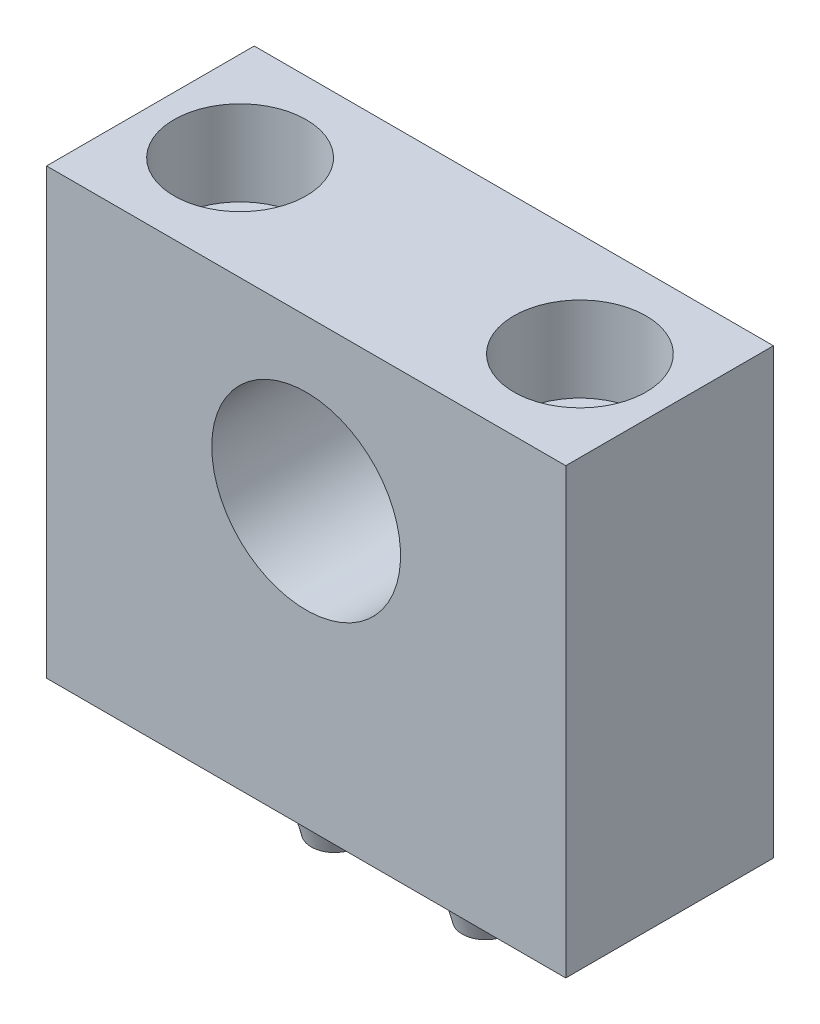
ISO-10303-21;
HEADER;
FILE_DESCRIPTION(('STEP AP214'),'2;1');
FILE_NAME('part.step','',(''),(''),'','','');
FILE_SCHEMA(('AUTOMOTIVE_DESIGN { 1 0 10303 214 1 1 1 1 }'));
ENDSEC;
DATA;
#1=APPLICATION_CONTEXT('core data for automotive mechanical design processes');
#2=APPLICATION_PROTOCOL_DEFINITION('international standard','automotive_design',2000,#1);
#3=PRODUCT_CONTEXT('',#1,'mechanical');
#4=PRODUCT('Part','Part','',(#3));
#5=PRODUCT_RELATED_PRODUCT_CATEGORY('part','',(#4));
#6=PRODUCT_DEFINITION_FORMATION('','',#4);
#7=PRODUCT_DEFINITION_CONTEXT('part definition',#1,'design');
#8=PRODUCT_DEFINITION('design','',#6,#7);
#9=PRODUCT_DEFINITION_SHAPE('','',#8);
#10=(LENGTH_UNIT() NAMED_UNIT(*) SI_UNIT(.MILLI.,.METRE.));
#11=(NAMED_UNIT(*) PLANE_ANGLE_UNIT() SI_UNIT($,.RADIAN.));
#12=(NAMED_UNIT(*) SI_UNIT($,.STERADIAN.) SOLID_ANGLE_UNIT());
#13=UNCERTAINTY_MEASURE_WITH_UNIT(LENGTH_MEASURE(1.E-05),#10,'distance_accuracy_value','');
#14=(GEOMETRIC_REPRESENTATION_CONTEXT(3) GLOBAL_UNCERTAINTY_ASSIGNED_CONTEXT((#13)) GLOBAL_UNIT_ASSIGNED_CONTEXT((#10,
#11,#12)) REPRESENTATION_CONTEXT('',''));
#15=CARTESIAN_POINT('',(0.,0.,0.));
#16=DIRECTION('',(0.,0.,1.));
#17=DIRECTION('',(1.,0.,0.));
#18=AXIS2_PLACEMENT_3D('',#15,#16,#17);
#19=CARTESIAN_POINT('',(18.,47.,0.));
#20=DIRECTION('',(0.,-1.,0.));
#21=DIRECTION('',(0.,0.,1.));
#22=AXIS2_PLACEMENT_3D('',#19,#20,#21);
#23=CYLINDRICAL_SURFACE('',#22,4.5);
#24=CARTESIAN_POINT('',(18.,0.,0.));
#25=DIRECTION('',(0.,1.,0.));
#26=DIRECTION('',(0.,0.,-1.));
#27=AXIS2_PLACEMENT_3D('',#24,#25,#26);
#28=CIRCLE('',#27,4.5);
#29=CARTESIAN_POINT('',(18.,0.,-4.5));
#30=VERTEX_POINT('',#29);
#31=EDGE_CURVE('E135',#30,#30,#28,.T.);
#32=ORIENTED_EDGE('',*,*,#31,.F.);
#33=EDGE_LOOP('',(#32));
#34=FACE_BOUND('',#33,.T.);
#35=CARTESIAN_POINT('',(18.,38.,0.));
#36=DIRECTION('',(0.,1.,0.));
#37=DIRECTION('',(0.,0.,-1.));
#38=AXIS2_PLACEMENT_3D('',#35,#36,#37);
#39=CIRCLE('',#38,4.5);
#40=CARTESIAN_POINT('',(18.,38.,-4.5));
#41=VERTEX_POINT('',#40);
#42=EDGE_CURVE('E110',#41,#41,#39,.T.);
#43=ORIENTED_EDGE('',*,*,#42,.T.);
#44=EDGE_LOOP('',(#43));
#45=FACE_BOUND('',#44,.T.);
#46=ADVANCED_FACE('F16',(#34,#45),#23,.F.);
#47=CARTESIAN_POINT('',(-18.,47.,0.));
#48=DIRECTION('',(0.,-1.,0.));
#49=DIRECTION('',(0.,0.,1.));
#50=AXIS2_PLACEMENT_3D('',#47,#48,#49);
#51=CYLINDRICAL_SURFACE('',#50,4.5);
#52=CARTESIAN_POINT('',(-18.,0.,0.));
#53=DIRECTION('',(0.,1.,0.));
#54=DIRECTION('',(0.,0.,-1.));
#55=AXIS2_PLACEMENT_3D('',#52,#53,#54);
#56=CIRCLE('',#55,4.5);
#57=CARTESIAN_POINT('',(-18.,0.,-4.5));
#58=VERTEX_POINT('',#57);
#59=EDGE_CURVE('E127',#58,#58,#56,.T.);
#60=ORIENTED_EDGE('',*,*,#59,.F.);
#61=EDGE_LOOP('',(#60));
#62=FACE_BOUND('',#61,.T.);
#63=CARTESIAN_POINT('',(-18.,38.,0.));
#64=DIRECTION('',(0.,1.,0.));
#65=DIRECTION('',(0.,0.,-1.));
#66=AXIS2_PLACEMENT_3D('',#63,#64,#65);
#67=CIRCLE('',#66,4.5);
#68=CARTESIAN_POINT('',(-18.,38.,-4.5));
#69=VERTEX_POINT('',#68);
#70=EDGE_CURVE('E118',#69,#69,#67,.T.);
#71=ORIENTED_EDGE('',*,*,#70,.T.);
#72=EDGE_LOOP('',(#71));
#73=FACE_BOUND('',#72,.T.);
#74=ADVANCED_FACE('F228',(#62,#73),#51,.F.);
#75=CARTESIAN_POINT('',(0.,47.,0.));
#76=DIRECTION('',(0.,-1.,0.));
#77=DIRECTION('',(0.,0.,1.));
#78=AXIS2_PLACEMENT_3D('',#75,#76,#77);
#79=PLANE('',#78);
#80=CARTESIAN_POINT('',(18.,47.,0.));
#81=DIRECTION('',(0.,1.,0.));
#82=DIRECTION('',(0.,0.,-1.));
#83=AXIS2_PLACEMENT_3D('',#80,#81,#82);
#84=CIRCLE('',#83,7.);
#85=CARTESIAN_POINT('',(18.,47.,-7.));
#86=VERTEX_POINT('',#85);
#87=EDGE_CURVE('E105',#86,#86,#84,.T.);
#88=ORIENTED_EDGE('',*,*,#87,.F.);
#89=EDGE_LOOP('',(#88));
#90=FACE_BOUND('',#89,.T.);
#91=CARTESIAN_POINT('',(-18.,47.,0.));
#92=DIRECTION('',(0.,1.,0.));
#93=DIRECTION('',(0.,0.,-1.));
#94=AXIS2_PLACEMENT_3D('',#91,#92,#93);
#95=CIRCLE('',#94,7.);
#96=CARTESIAN_POINT('',(-18.,47.,-7.));
#97=VERTEX_POINT('',#96);
#98=EDGE_CURVE('E119',#97,#97,#95,.T.);
#99=ORIENTED_EDGE('',*,*,#98,.F.);
#100=EDGE_LOOP('',(#99));
#101=FACE_BOUND('',#100,.T.);
#102=DIRECTION('',(0.,0.,1.));
#103=VECTOR('',#102,1.);
#104=CARTESIAN_POINT('',(-27.5,47.,-11.));
#105=LINE('',#104,#103);
#106=CARTESIAN_POINT('',(-27.5,47.,-11.));
#107=VERTEX_POINT('',#106);
#108=CARTESIAN_POINT('',(-27.5,47.,11.));
#109=VERTEX_POINT('',#108);
#110=EDGE_CURVE('E140',#107,#109,#105,.T.);
#111=ORIENTED_EDGE('',*,*,#110,.T.);
#112=DIRECTION('',(1.,0.,0.));
#113=VECTOR('',#112,1.);
#114=CARTESIAN_POINT('',(27.5,47.,11.));
#115=LINE('',#114,#113);
#116=CARTESIAN_POINT('',(27.5,47.,11.));
#117=VERTEX_POINT('',#116);
#118=EDGE_CURVE('E67',#109,#117,#115,.T.);
#119=ORIENTED_EDGE('',*,*,#118,.T.);
#120=DIRECTION('',(0.,0.,-1.));
#121=VECTOR('',#120,1.);
#122=CARTESIAN_POINT('',(27.5,47.,-11.));
#123=LINE('',#122,#121);
#124=CARTESIAN_POINT('',(27.5,47.,-11.));
#125=VERTEX_POINT('',#124);
#126=EDGE_CURVE('E145',#117,#125,#123,.T.);
#127=ORIENTED_EDGE('',*,*,#126,.T.);
#128=DIRECTION('',(-1.,0.,0.));
#129=VECTOR('',#128,1.);
#130=CARTESIAN_POINT('',(27.5,47.,-11.));
#131=LINE('',#130,#129);
#132=EDGE_CURVE('E35',#125,#107,#131,.T.);
#133=ORIENTED_EDGE('',*,*,#132,.T.);
#134=EDGE_LOOP('',(#111,#119,#127,#133));
#135=FACE_BOUND('',#134,.T.);
#136=ADVANCED_FACE('F234',(#90,#101,#135),#79,.F.);
#137=CARTESIAN_POINT('',(0.,0.,0.));
#138=DIRECTION('',(0.,-1.,0.));
#139=DIRECTION('',(0.,0.,1.));
#140=AXIS2_PLACEMENT_3D('',#137,#138,#139);
#141=PLANE('',#140);
#142=CARTESIAN_POINT('',(8.,0.,0.));
#143=DIRECTION('',(0.,-1.,0.));
#144=DIRECTION('',(0.,0.,1.));
#145=AXIS2_PLACEMENT_3D('',#142,#143,#144);
#146=CIRCLE('',#145,3.);
#147=CARTESIAN_POINT('',(8.,0.,3.));
#148=VERTEX_POINT('',#147);
#149=EDGE_CURVE('E88',#148,#148,#146,.T.);
#150=ORIENTED_EDGE('',*,*,#149,.F.);
#151=EDGE_LOOP('',(#150));
#152=FACE_BOUND('',#151,.T.);
#153=CARTESIAN_POINT('',(-8.,0.,0.));
#154=DIRECTION('',(0.,-1.,0.));
#155=DIRECTION('',(0.,0.,1.));
#156=AXIS2_PLACEMENT_3D('',#153,#154,#155);
#157=CIRCLE('',#156,3.);
#158=CARTESIAN_POINT('',(-8.,0.,3.));
#159=VERTEX_POINT('',#158);
#160=EDGE_CURVE('E87',#159,#159,#157,.T.);
#161=ORIENTED_EDGE('',*,*,#160,.F.);
#162=EDGE_LOOP('',(#161));
#163=FACE_BOUND('',#162,.T.);
#164=ORIENTED_EDGE('',*,*,#31,.T.);
#165=EDGE_LOOP('',(#164));
#166=FACE_BOUND('',#165,.T.);
#167=DIRECTION('',(0.,0.,1.));
#168=VECTOR('',#167,1.);
#169=CARTESIAN_POINT('',(-27.5,0.,-11.));
#170=LINE('',#169,#168);
#171=CARTESIAN_POINT('',(-27.5,0.,-11.));
#172=VERTEX_POINT('',#171);
#173=CARTESIAN_POINT('',(-27.5,0.,11.));
#174=VERTEX_POINT('',#173);
#175=EDGE_CURVE('E139',#172,#174,#170,.T.);
#176=ORIENTED_EDGE('',*,*,#175,.F.);
#177=DIRECTION('',(-1.,0.,0.));
#178=VECTOR('',#177,1.);
#179=CARTESIAN_POINT('',(27.5,0.,-11.));
#180=LINE('',#179,#178);
#181=CARTESIAN_POINT('',(27.5,0.,-11.));
#182=VERTEX_POINT('',#181);
#183=EDGE_CURVE('E59',#182,#172,#180,.T.);
#184=ORIENTED_EDGE('',*,*,#183,.F.);
#185=DIRECTION('',(0.,0.,-1.));
#186=VECTOR('',#185,1.);
#187=CARTESIAN_POINT('',(27.5,0.,-11.));
#188=LINE('',#187,#186);
#189=CARTESIAN_POINT('',(27.5,0.,11.));
#190=VERTEX_POINT('',#189);
#191=EDGE_CURVE('E53',#190,#182,#188,.T.);
#192=ORIENTED_EDGE('',*,*,#191,.F.);
#193=DIRECTION('',(1.,0.,0.));
#194=VECTOR('',#193,1.);
#195=CARTESIAN_POINT('',(27.5,0.,11.));
#196=LINE('',#195,#194);
#197=EDGE_CURVE('E154',#174,#190,#196,.T.);
#198=ORIENTED_EDGE('',*,*,#197,.F.);
#199=EDGE_LOOP('',(#176,#184,#192,#198));
#200=FACE_BOUND('',#199,.T.);
#201=ORIENTED_EDGE('',*,*,#59,.T.);
#202=EDGE_LOOP('',(#201));
#203=FACE_BOUND('',#202,.T.);
#204=ADVANCED_FACE('F243',(#152,#163,#166,#200,#203),#141,.T.);
#205=CARTESIAN_POINT('',(-27.5,47.,-11.));
#206=DIRECTION('',(1.,0.,0.));
#207=DIRECTION('',(0.,0.,-1.));
#208=AXIS2_PLACEMENT_3D('',#205,#206,#207);
#209=PLANE('',#208);
#210=ORIENTED_EDGE('',*,*,#175,.T.);
#211=DIRECTION('',(0.,-1.,0.));
#212=VECTOR('',#211,1.);
#213=CARTESIAN_POINT('',(-27.5,47.,11.));
#214=LINE('',#213,#212);
#215=EDGE_CURVE('E169',#109,#174,#214,.T.);
#216=ORIENTED_EDGE('',*,*,#215,.F.);
#217=ORIENTED_EDGE('',*,*,#110,.F.);
#218=DIRECTION('',(0.,-1.,0.));
#219=VECTOR('',#218,1.);
#220=CARTESIAN_POINT('',(-27.5,47.,-11.));
#221=LINE('',#220,#219);
#222=EDGE_CURVE('E150',#107,#172,#221,.T.);
#223=ORIENTED_EDGE('',*,*,#222,.T.);
#224=EDGE_LOOP('',(#210,#216,#217,#223));
#225=FACE_BOUND('',#224,.T.);
#226=ADVANCED_FACE('F18',(#225),#209,.F.);
#227=CARTESIAN_POINT('',(27.5,47.,11.));
#228=DIRECTION('',(0.,0.,-1.));
#229=DIRECTION('',(-1.,0.,0.));
#230=AXIS2_PLACEMENT_3D('',#227,#228,#229);
#231=PLANE('',#230);
#232=CARTESIAN_POINT('',(0.,30.,11.));
#233=DIRECTION('',(0.,0.,-1.));
#234=DIRECTION('',(-1.,0.,0.));
#235=AXIS2_PLACEMENT_3D('',#232,#233,#234);
#236=CIRCLE('',#235,10.);
#237=CARTESIAN_POINT('',(-10.,30.,11.));
#238=VERTEX_POINT('',#237);
#239=EDGE_CURVE('E123',#238,#238,#236,.T.);
#240=ORIENTED_EDGE('',*,*,#239,.T.);
#241=EDGE_LOOP('',(#240));
#242=FACE_BOUND('',#241,.T.);
#243=ORIENTED_EDGE('',*,*,#197,.T.);
#244=DIRECTION('',(0.,-1.,0.));
#245=VECTOR('',#244,1.);
#246=CARTESIAN_POINT('',(27.5,47.,11.));
#247=LINE('',#246,#245);
#248=EDGE_CURVE('E166',#117,#190,#247,.T.);
#249=ORIENTED_EDGE('',*,*,#248,.F.);
#250=ORIENTED_EDGE('',*,*,#118,.F.);
#251=ORIENTED_EDGE('',*,*,#215,.T.);
#252=EDGE_LOOP('',(#243,#249,#250,#251));
#253=FACE_BOUND('',#252,.T.);
#254=ADVANCED_FACE('F255',(#242,#253),#231,.F.);
#255=CARTESIAN_POINT('',(27.5,47.,-11.));
#256=DIRECTION('',(-1.,0.,0.));
#257=DIRECTION('',(0.,0.,1.));
#258=AXIS2_PLACEMENT_3D('',#255,#256,#257);
#259=PLANE('',#258);
#260=ORIENTED_EDGE('',*,*,#191,.T.);
#261=DIRECTION('',(0.,-1.,0.));
#262=VECTOR('',#261,1.);
#263=CARTESIAN_POINT('',(27.5,47.,-11.));
#264=LINE('',#263,#262);
#265=EDGE_CURVE('E163',#125,#182,#264,.T.);
#266=ORIENTED_EDGE('',*,*,#265,.F.);
#267=ORIENTED_EDGE('',*,*,#126,.F.);
#268=ORIENTED_EDGE('',*,*,#248,.T.);
#269=EDGE_LOOP('',(#260,#266,#267,#268));
#270=FACE_BOUND('',#269,.T.);
#271=ADVANCED_FACE('F252',(#270),#259,.F.);
#272=CARTESIAN_POINT('',(27.5,47.,-11.));
#273=DIRECTION('',(0.,0.,1.));
#274=DIRECTION('',(1.,0.,0.));
#275=AXIS2_PLACEMENT_3D('',#272,#273,#274);
#276=PLANE('',#275);
#277=CARTESIAN_POINT('',(0.,30.,-11.));
#278=DIRECTION('',(0.,0.,-1.));
#279=DIRECTION('',(-1.,0.,0.));
#280=AXIS2_PLACEMENT_3D('',#277,#278,#279);
#281=CIRCLE('',#280,10.);
#282=CARTESIAN_POINT('',(-10.,30.,-11.));
#283=VERTEX_POINT('',#282);
#284=EDGE_CURVE('E128',#283,#283,#281,.T.);
#285=ORIENTED_EDGE('',*,*,#284,.F.);
#286=EDGE_LOOP('',(#285));
#287=FACE_BOUND('',#286,.T.);
#288=ORIENTED_EDGE('',*,*,#183,.T.);
#289=ORIENTED_EDGE('',*,*,#222,.F.);
#290=ORIENTED_EDGE('',*,*,#132,.F.);
#291=ORIENTED_EDGE('',*,*,#265,.T.);
#292=EDGE_LOOP('',(#288,#289,#290,#291));
#293=FACE_BOUND('',#292,.T.);
#294=ADVANCED_FACE('F248',(#287,#293),#276,.F.);
#295=CARTESIAN_POINT('',(0.,30.,11.));
#296=DIRECTION('',(0.,0.,-1.));
#297=DIRECTION('',(-1.,0.,0.));
#298=AXIS2_PLACEMENT_3D('',#295,#296,#297);
#299=CYLINDRICAL_SURFACE('',#298,10.);
#300=ORIENTED_EDGE('',*,*,#239,.F.);
#301=EDGE_LOOP('',(#300));
#302=FACE_BOUND('',#301,.T.);
#303=ORIENTED_EDGE('',*,*,#284,.T.);
#304=EDGE_LOOP('',(#303));
#305=FACE_BOUND('',#304,.T.);
#306=ADVANCED_FACE('F251',(#302,#305),#299,.F.);
#307=CARTESIAN_POINT('',(-18.,38.,0.));
#308=DIRECTION('',(0.,1.,0.));
#309=DIRECTION('',(0.,0.,-1.));
#310=AXIS2_PLACEMENT_3D('',#307,#308,#309);
#311=CYLINDRICAL_SURFACE('',#310,7.);
#312=CARTESIAN_POINT('',(-18.,38.,0.));
#313=DIRECTION('',(0.,1.,0.));
#314=DIRECTION('',(0.,0.,-1.));
#315=AXIS2_PLACEMENT_3D('',#312,#313,#314);
#316=CIRCLE('',#315,7.);
#317=CARTESIAN_POINT('',(-18.,38.,-7.));
#318=VERTEX_POINT('',#317);
#319=EDGE_CURVE('E114',#318,#318,#316,.T.);
#320=ORIENTED_EDGE('',*,*,#319,.F.);
#321=EDGE_LOOP('',(#320));
#322=FACE_BOUND('',#321,.T.);
#323=ORIENTED_EDGE('',*,*,#98,.T.);
#324=EDGE_LOOP('',(#323));
#325=FACE_BOUND('',#324,.T.);
#326=ADVANCED_FACE('F277',(#322,#325),#311,.F.);
#327=CARTESIAN_POINT('',(-18.,38.,0.));
#328=DIRECTION('',(0.,1.,0.));
#329=DIRECTION('',(0.,0.,-1.));
#330=AXIS2_PLACEMENT_3D('',#327,#328,#329);
#331=PLANE('',#330);
#332=ORIENTED_EDGE('',*,*,#70,.F.);
#333=EDGE_LOOP('',(#332));
#334=FACE_BOUND('',#333,.T.);
#335=ORIENTED_EDGE('',*,*,#319,.T.);
#336=EDGE_LOOP('',(#335));
#337=FACE_BOUND('',#336,.T.);
#338=ADVANCED_FACE('F273',(#334,#337),#331,.T.);
#339=CARTESIAN_POINT('',(18.,38.,0.));
#340=DIRECTION('',(0.,1.,0.));
#341=DIRECTION('',(0.,0.,-1.));
#342=AXIS2_PLACEMENT_3D('',#339,#340,#341);
#343=CYLINDRICAL_SURFACE('',#342,7.);
#344=CARTESIAN_POINT('',(18.,38.,0.));
#345=DIRECTION('',(0.,1.,0.));
#346=DIRECTION('',(0.,0.,-1.));
#347=AXIS2_PLACEMENT_3D('',#344,#345,#346);
#348=CIRCLE('',#347,7.);
#349=CARTESIAN_POINT('',(18.,38.,-7.));
#350=VERTEX_POINT('',#349);
#351=EDGE_CURVE('E106',#350,#350,#348,.T.);
#352=ORIENTED_EDGE('',*,*,#351,.F.);
#353=EDGE_LOOP('',(#352));
#354=FACE_BOUND('',#353,.T.);
#355=ORIENTED_EDGE('',*,*,#87,.T.);
#356=EDGE_LOOP('',(#355));
#357=FACE_BOUND('',#356,.T.);
#358=ADVANCED_FACE('F276',(#354,#357),#343,.F.);
#359=CARTESIAN_POINT('',(18.,38.,0.));
#360=DIRECTION('',(0.,1.,0.));
#361=DIRECTION('',(0.,0.,-1.));
#362=AXIS2_PLACEMENT_3D('',#359,#360,#361);
#363=PLANE('',#362);
#364=ORIENTED_EDGE('',*,*,#42,.F.);
#365=EDGE_LOOP('',(#364));
#366=FACE_BOUND('',#365,.T.);
#367=ORIENTED_EDGE('',*,*,#351,.T.);
#368=EDGE_LOOP('',(#367));
#369=FACE_BOUND('',#368,.T.);
#370=ADVANCED_FACE('F198',(#366,#369),#363,.T.);
#371=CARTESIAN_POINT('',(8.,20.,0.));
#372=DIRECTION('',(0.,1.,0.));
#373=DIRECTION('',(0.,0.,1.));
#374=AXIS2_PLACEMENT_3D('',#371,#372,#373);
#375=CYLINDRICAL_SURFACE('',#374,3.);
#376=ORIENTED_EDGE('',*,*,#149,.T.);
#377=EDGE_LOOP('',(#376));
#378=FACE_BOUND('',#377,.T.);
#379=CARTESIAN_POINT('',(8.,-8.,0.));
#380=DIRECTION('',(0.,1.,0.));
#381=DIRECTION('',(0.,0.,1.));
#382=AXIS2_PLACEMENT_3D('',#379,#380,#381);
#383=CIRCLE('',#382,3.);
#384=CARTESIAN_POINT('',(8.,-8.,3.));
#385=VERTEX_POINT('',#384);
#386=EDGE_CURVE('E98',#385,#385,#383,.T.);
#387=ORIENTED_EDGE('',*,*,#386,.T.);
#388=EDGE_LOOP('',(#387));
#389=FACE_BOUND('',#388,.T.);
#390=ADVANCED_FACE('F194',(#378,#389),#375,.T.);
#391=CARTESIAN_POINT('',(8.,-10.,0.));
#392=DIRECTION('',(0.,1.,0.));
#393=DIRECTION('',(0.,0.,1.));
#394=AXIS2_PLACEMENT_3D('',#391,#392,#393);
#395=CONICAL_SURFACE('',#394,2.46410161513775,0.26179938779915);
#396=ORIENTED_EDGE('',*,*,#386,.F.);
#397=EDGE_LOOP('',(#396));
#398=FACE_BOUND('',#397,.T.);
#399=CARTESIAN_POINT('',(8.,-10.,0.));
#400=DIRECTION('',(0.,1.,0.));
#401=DIRECTION('',(0.,0.,1.));
#402=AXIS2_PLACEMENT_3D('',#399,#400,#401);
#403=CIRCLE('',#402,2.46410161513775);
#404=CARTESIAN_POINT('',(8.,-10.,2.46410161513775));
#405=VERTEX_POINT('',#404);
#406=EDGE_CURVE('E524',#405,#405,#403,.T.);
#407=ORIENTED_EDGE('',*,*,#406,.T.);
#408=EDGE_LOOP('',(#407));
#409=FACE_BOUND('',#408,.T.);
#410=ADVANCED_FACE('F197',(#398,#409),#395,.T.);
#411=CARTESIAN_POINT('',(8.,-10.,0.));
#412=DIRECTION('',(0.,1.,0.));
#413=DIRECTION('',(0.,0.,1.));
#414=AXIS2_PLACEMENT_3D('',#411,#412,#413);
#415=PLANE('',#414);
#416=ORIENTED_EDGE('',*,*,#406,.F.);
#417=EDGE_LOOP('',(#416));
#418=FACE_BOUND('',#417,.T.);
#419=ADVANCED_FACE('F202',(#418),#415,.F.);
#420=CARTESIAN_POINT('',(-8.,20.,0.));
#421=DIRECTION('',(0.,1.,0.));
#422=DIRECTION('',(0.,0.,1.));
#423=AXIS2_PLACEMENT_3D('',#420,#421,#422);
#424=CYLINDRICAL_SURFACE('',#423,3.);
#425=ORIENTED_EDGE('',*,*,#160,.T.);
#426=EDGE_LOOP('',(#425));
#427=FACE_BOUND('',#426,.T.);
#428=CARTESIAN_POINT('',(-8.,-8.,0.));
#429=DIRECTION('',(0.,1.,0.));
#430=DIRECTION('',(0.,0.,1.));
#431=AXIS2_PLACEMENT_3D('',#428,#429,#430);
#432=CIRCLE('',#431,3.);
#433=CARTESIAN_POINT('',(-8.,-8.,3.));
#434=VERTEX_POINT('',#433);
#435=EDGE_CURVE('E522',#434,#434,#432,.T.);
#436=ORIENTED_EDGE('',*,*,#435,.T.);
#437=EDGE_LOOP('',(#436));
#438=FACE_BOUND('',#437,.T.);
#439=ADVANCED_FACE('F206',(#427,#438),#424,.T.);
#440=CARTESIAN_POINT('',(-8.,-10.,0.));
#441=DIRECTION('',(0.,1.,0.));
#442=DIRECTION('',(0.,0.,1.));
#443=AXIS2_PLACEMENT_3D('',#440,#441,#442);
#444=CONICAL_SURFACE('',#443,2.46410161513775,0.26179938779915);
#445=ORIENTED_EDGE('',*,*,#435,.F.);
#446=EDGE_LOOP('',(#445));
#447=FACE_BOUND('',#446,.T.);
#448=CARTESIAN_POINT('',(-8.,-10.,0.));
#449=DIRECTION('',(0.,1.,0.));
#450=DIRECTION('',(0.,0.,1.));
#451=AXIS2_PLACEMENT_3D('',#448,#449,#450);
#452=CIRCLE('',#451,2.46410161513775);
#453=CARTESIAN_POINT('',(-8.,-10.,2.46410161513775));
#454=VERTEX_POINT('',#453);
#455=EDGE_CURVE('E525',#454,#454,#452,.T.);
#456=ORIENTED_EDGE('',*,*,#455,.T.);
#457=EDGE_LOOP('',(#456));
#458=FACE_BOUND('',#457,.T.);
#459=ADVANCED_FACE('F216',(#447,#458),#444,.T.);
#460=CARTESIAN_POINT('',(-8.,-10.,0.));
#461=DIRECTION('',(0.,1.,0.));
#462=DIRECTION('',(0.,0.,1.));
#463=AXIS2_PLACEMENT_3D('',#460,#461,#462);
#464=PLANE('',#463);
#465=ORIENTED_EDGE('',*,*,#455,.F.);
#466=EDGE_LOOP('',(#465));
#467=FACE_BOUND('',#466,.T.);
#468=ADVANCED_FACE('F220',(#467),#464,.F.);
#469=CLOSED_SHELL('',(#46,#74,#136,#204,#226,#254,#271,#294,#306,#326,#338,#358,#370,#390,#410,
#419,#439,#459,#468));
#470=CARTESIAN_POINT('',(-8.,4.,0.));
#471=DIRECTION('',(0.,1.,0.));
#472=DIRECTION('',(0.,0.,-1.));
#473=AXIS2_PLACEMENT_3D('',#470,#471,#472);
#474=SPHERICAL_SURFACE('',#473,6.);
#475=CARTESIAN_POINT('',(-8.,9.19615242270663,0.));
#476=DIRECTION('',(0.,-1.,0.));
#477=DIRECTION('',(0.,0.,-1.));
#478=AXIS2_PLACEMENT_3D('',#475,#476,#477);
#479=CIRCLE('',#478,3.);
#480=CARTESIAN_POINT('',(-8.,9.19615242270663,-3.));
#481=VERTEX_POINT('',#480);
#482=EDGE_CURVE('E10',#481,#481,#479,.F.);
#483=ORIENTED_EDGE('',*,*,#482,.T.);
#484=EDGE_LOOP('',(#483));
#485=FACE_BOUND('',#484,.T.);
#486=ADVANCED_FACE('F208',(#485),#474,.T.);
#487=CARTESIAN_POINT('',(-8.,12.,0.));
#488=DIRECTION('',(0.,-1.,0.));
#489=DIRECTION('',(0.,0.,1.));
#490=AXIS2_PLACEMENT_3D('',#487,#488,#489);
#491=CONICAL_SURFACE('',#490,3.,1.02974425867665);
#492=CARTESIAN_POINT('',(-8.,13.8025818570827,0.));
#493=VERTEX_POINT('',#492);
#494=VERTEX_LOOP('',#493);
#495=FACE_BOUND('',#494,.T.);
#496=CARTESIAN_POINT('',(-8.,12.,0.));
#497=DIRECTION('',(0.,-1.,0.));
#498=DIRECTION('',(0.,0.,1.));
#499=AXIS2_PLACEMENT_3D('',#496,#497,#498);
#500=CIRCLE('',#499,3.);
#501=CARTESIAN_POINT('',(-8.,12.,3.));
#502=VERTEX_POINT('',#501);
#503=EDGE_CURVE('E95',#502,#502,#500,.T.);
#504=ORIENTED_EDGE('',*,*,#503,.T.);
#505=EDGE_LOOP('',(#504));
#506=FACE_BOUND('',#505,.T.);
#507=ADVANCED_FACE('F211',(#495,#506),#491,.F.);
#508=CARTESIAN_POINT('',(-8.,0.,0.));
#509=DIRECTION('',(0.,-1.,0.));
#510=DIRECTION('',(0.,0.,1.));
#511=AXIS2_PLACEMENT_3D('',#508,#509,#510);
#512=CYLINDRICAL_SURFACE('',#511,3.);
#513=ORIENTED_EDGE('',*,*,#503,.F.);
#514=EDGE_LOOP('',(#513));
#515=FACE_BOUND('',#514,.T.);
#516=ORIENTED_EDGE('',*,*,#482,.F.);
#517=EDGE_LOOP('',(#516));
#518=FACE_BOUND('',#517,.T.);
#519=ADVANCED_FACE('F299',(#515,#518),#512,.F.);
#520=CLOSED_SHELL('',(#486,#507,#519));
#521=CARTESIAN_POINT('',(8.,4.,0.));
#522=DIRECTION('',(0.,1.,0.));
#523=DIRECTION('',(0.,0.,-1.));
#524=AXIS2_PLACEMENT_3D('',#521,#522,#523);
#525=SPHERICAL_SURFACE('',#524,6.);
#526=CARTESIAN_POINT('',(8.,9.19615242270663,0.));
#527=DIRECTION('',(0.,-1.,0.));
#528=DIRECTION('',(0.,0.,-1.));
#529=AXIS2_PLACEMENT_3D('',#526,#527,#528);
#530=CIRCLE('',#529,3.);
#531=CARTESIAN_POINT('',(8.,9.19615242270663,-3.));
#532=VERTEX_POINT('',#531);
#533=EDGE_CURVE('E27',#532,#532,#530,.F.);
#534=ORIENTED_EDGE('',*,*,#533,.T.);
#535=EDGE_LOOP('',(#534));
#536=FACE_BOUND('',#535,.T.);
#537=ADVANCED_FACE('F78',(#536),#525,.T.);
#538=CARTESIAN_POINT('',(8.,12.,0.));
#539=DIRECTION('',(0.,-1.,0.));
#540=DIRECTION('',(0.,0.,1.));
#541=AXIS2_PLACEMENT_3D('',#538,#539,#540);
#542=CONICAL_SURFACE('',#541,3.,1.02974425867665);
#543=CARTESIAN_POINT('',(8.,13.8025818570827,0.));
#544=VERTEX_POINT('',#543);
#545=VERTEX_LOOP('',#544);
#546=FACE_BOUND('',#545,.T.);
#547=CARTESIAN_POINT('',(8.,12.,0.));
#548=DIRECTION('',(0.,-1.,0.));
#549=DIRECTION('',(0.,0.,1.));
#550=AXIS2_PLACEMENT_3D('',#547,#548,#549);
#551=CIRCLE('',#550,3.);
#552=CARTESIAN_POINT('',(8.,12.,3.));
#553=VERTEX_POINT('',#552);
#554=EDGE_CURVE('E84',#553,#553,#551,.T.);
#555=ORIENTED_EDGE('',*,*,#554,.T.);
#556=EDGE_LOOP('',(#555));
#557=FACE_BOUND('',#556,.T.);
#558=ADVANCED_FACE('F74',(#546,#557),#542,.F.);
#559=CARTESIAN_POINT('',(8.,0.,0.));
#560=DIRECTION('',(0.,-1.,0.));
#561=DIRECTION('',(0.,0.,1.));
#562=AXIS2_PLACEMENT_3D('',#559,#560,#561);
#563=CYLINDRICAL_SURFACE('',#562,3.);
#564=ORIENTED_EDGE('',*,*,#554,.F.);
#565=EDGE_LOOP('',(#564));
#566=FACE_BOUND('',#565,.T.);
#567=ORIENTED_EDGE('',*,*,#533,.F.);
#568=EDGE_LOOP('',(#567));
#569=FACE_BOUND('',#568,.T.);
#570=ADVANCED_FACE('F77',(#566,#569),#563,.F.);
#571=CLOSED_SHELL('',(#537,#558,#570));
#572=ORIENTED_CLOSED_SHELL('',*,#520,.T.);
#573=ORIENTED_CLOSED_SHELL('',*,#571,.T.);
#574=BREP_WITH_VOIDS('B1',#469,(#572,#573));
#575=ADVANCED_BREP_SHAPE_REPRESENTATION('',(#18,#574),#14);
#576=SHAPE_DEFINITION_REPRESENTATION(#9,#575);
ENDSEC;
END-ISO-10303-21;
